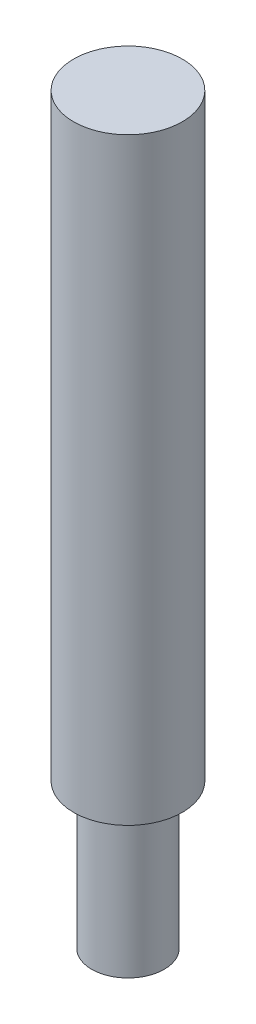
ISO-10303-21;
HEADER;
FILE_DESCRIPTION(('STEP AP214'),'2;1');
FILE_NAME('part.step','',(''),(''),'','','');
FILE_SCHEMA(('AUTOMOTIVE_DESIGN { 1 0 10303 214 1 1 1 1 }'));
ENDSEC;
DATA;
#1=APPLICATION_CONTEXT('core data for automotive mechanical design processes');
#2=APPLICATION_PROTOCOL_DEFINITION('international standard','automotive_design',2000,#1);
#3=PRODUCT_CONTEXT('',#1,'mechanical');
#4=PRODUCT('Part','Part','',(#3));
#5=PRODUCT_RELATED_PRODUCT_CATEGORY('part','',(#4));
#6=PRODUCT_DEFINITION_FORMATION('','',#4);
#7=PRODUCT_DEFINITION_CONTEXT('part definition',#1,'design');
#8=PRODUCT_DEFINITION('design','',#6,#7);
#9=PRODUCT_DEFINITION_SHAPE('','',#8);
#10=(LENGTH_UNIT() NAMED_UNIT(*) SI_UNIT(.MILLI.,.METRE.));
#11=(NAMED_UNIT(*) PLANE_ANGLE_UNIT() SI_UNIT($,.RADIAN.));
#12=(NAMED_UNIT(*) SI_UNIT($,.STERADIAN.) SOLID_ANGLE_UNIT());
#13=UNCERTAINTY_MEASURE_WITH_UNIT(LENGTH_MEASURE(1.E-05),#10,'distance_accuracy_value','');
#14=(GEOMETRIC_REPRESENTATION_CONTEXT(3) GLOBAL_UNCERTAINTY_ASSIGNED_CONTEXT((#13)) GLOBAL_UNIT_ASSIGNED_CONTEXT((#10,
#11,#12)) REPRESENTATION_CONTEXT('',''));
#15=CARTESIAN_POINT('',(0.,0.,0.));
#16=DIRECTION('',(0.,0.,1.));
#17=DIRECTION('',(1.,0.,0.));
#18=AXIS2_PLACEMENT_3D('',#15,#16,#17);
#19=CARTESIAN_POINT('',(1.5,0.,0.));
#20=DIRECTION('',(0.,1.,0.));
#21=DIRECTION('',(0.,0.,1.));
#22=AXIS2_PLACEMENT_3D('',#19,#20,#21);
#23=PLANE('',#22);
#24=CARTESIAN_POINT('',(1.5,0.,0.));
#25=DIRECTION('',(0.,1.,0.));
#26=DIRECTION('',(0.,0.,1.));
#27=AXIS2_PLACEMENT_3D('',#24,#25,#26);
#28=CIRCLE('',#27,1.5);
#29=CARTESIAN_POINT('',(1.5,0.,1.5));
#30=VERTEX_POINT('',#29);
#31=EDGE_CURVE('E110',#30,#30,#28,.T.);
#32=ORIENTED_EDGE('',*,*,#31,.F.);
#33=EDGE_LOOP('',(#32));
#34=FACE_BOUND('',#33,.T.);
#35=CARTESIAN_POINT('',(1.5,0.,0.));
#36=DIRECTION('',(0.,1.,0.));
#37=DIRECTION('',(0.,0.,1.));
#38=AXIS2_PLACEMENT_3D('',#35,#36,#37);
#39=CIRCLE('',#38,1.);
#40=CARTESIAN_POINT('',(1.5,0.,1.));
#41=VERTEX_POINT('',#40);
#42=EDGE_CURVE('E11',#41,#41,#39,.F.);
#43=ORIENTED_EDGE('',*,*,#42,.F.);
#44=EDGE_LOOP('',(#43));
#45=FACE_BOUND('',#44,.T.);
#46=ADVANCED_FACE('F39',(#34,#45),#23,.F.);
#47=CARTESIAN_POINT('',(1.5,16.5,0.));
#48=DIRECTION('',(0.,-1.,0.));
#49=DIRECTION('',(0.,0.,-1.));
#50=AXIS2_PLACEMENT_3D('',#47,#48,#49);
#51=CYLINDRICAL_SURFACE('',#50,1.5);
#52=ORIENTED_EDGE('',*,*,#31,.T.);
#53=EDGE_LOOP('',(#52));
#54=FACE_BOUND('',#53,.T.);
#55=CARTESIAN_POINT('',(1.5,16.5,0.));
#56=DIRECTION('',(0.,1.,0.));
#57=DIRECTION('',(0.,0.,1.));
#58=AXIS2_PLACEMENT_3D('',#55,#56,#57);
#59=CIRCLE('',#58,1.5);
#60=CARTESIAN_POINT('',(1.5,16.5,1.5));
#61=VERTEX_POINT('',#60);
#62=EDGE_CURVE('E114',#61,#61,#59,.T.);
#63=ORIENTED_EDGE('',*,*,#62,.F.);
#64=EDGE_LOOP('',(#63));
#65=FACE_BOUND('',#64,.T.);
#66=CARTESIAN_POINT('',(1.5,12.,0.));
#67=DIRECTION('',(0.,-1.,0.));
#68=DIRECTION('',(0.,0.,-1.));
#69=AXIS2_PLACEMENT_3D('',#66,#67,#68);
#70=CIRCLE('',#69,1.5);
#71=CARTESIAN_POINT('',(0.0857864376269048,12.,0.5));
#72=VERTEX_POINT('',#71);
#73=CARTESIAN_POINT('',(0.0857864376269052,12.,-0.5));
#74=VERTEX_POINT('',#73);
#75=EDGE_CURVE('E117',#72,#74,#70,.T.);
#76=ORIENTED_EDGE('',*,*,#75,.F.);
#77=DIRECTION('',(0.,-1.,0.));
#78=VECTOR('',#77,1.);
#79=CARTESIAN_POINT('',(0.0857864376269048,16.5,0.5));
#80=LINE('',#79,#78);
#81=CARTESIAN_POINT('',(0.0857864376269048,10.5,0.5));
#82=VERTEX_POINT('',#81);
#83=EDGE_CURVE('E47',#72,#82,#80,.T.);
#84=ORIENTED_EDGE('',*,*,#83,.T.);
#85=CARTESIAN_POINT('',(1.5,10.5,0.));
#86=DIRECTION('',(0.,-1.,0.));
#87=DIRECTION('',(0.,0.,-1.));
#88=AXIS2_PLACEMENT_3D('',#85,#86,#87);
#89=CIRCLE('',#88,1.5);
#90=CARTESIAN_POINT('',(0.0857864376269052,10.5,-0.5));
#91=VERTEX_POINT('',#90);
#92=EDGE_CURVE('E54',#82,#91,#89,.T.);
#93=ORIENTED_EDGE('',*,*,#92,.T.);
#94=DIRECTION('',(0.,-1.,0.));
#95=VECTOR('',#94,1.);
#96=CARTESIAN_POINT('',(0.0857864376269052,16.5,-0.5));
#97=LINE('',#96,#95);
#98=EDGE_CURVE('E62',#74,#91,#97,.T.);
#99=ORIENTED_EDGE('',*,*,#98,.F.);
#100=EDGE_LOOP('',(#76,#84,#93,#99));
#101=FACE_BOUND('',#100,.T.);
#102=ADVANCED_FACE('F41',(#54,#65,#101),#51,.T.);
#103=CARTESIAN_POINT('',(1.5,16.5,0.));
#104=DIRECTION('',(0.,1.,0.));
#105=DIRECTION('',(0.,0.,1.));
#106=AXIS2_PLACEMENT_3D('',#103,#104,#105);
#107=PLANE('',#106);
#108=ORIENTED_EDGE('',*,*,#62,.T.);
#109=EDGE_LOOP('',(#108));
#110=FACE_BOUND('',#109,.T.);
#111=ADVANCED_FACE('F134',(#110),#107,.T.);
#112=CARTESIAN_POINT('',(1.,10.5,-0.5));
#113=DIRECTION('',(0.,-1.,0.));
#114=DIRECTION('',(0.,0.,-1.));
#115=AXIS2_PLACEMENT_3D('',#112,#113,#114);
#116=PLANE('',#115);
#117=DIRECTION('',(-1.,0.,0.));
#118=VECTOR('',#117,1.);
#119=CARTESIAN_POINT('',(1.,10.5,0.5));
#120=LINE('',#119,#118);
#121=CARTESIAN_POINT('',(1.,10.5,0.5));
#122=VERTEX_POINT('',#121);
#123=EDGE_CURVE('E79',#122,#82,#120,.T.);
#124=ORIENTED_EDGE('',*,*,#123,.F.);
#125=DIRECTION('',(0.,0.,1.));
#126=VECTOR('',#125,1.);
#127=CARTESIAN_POINT('',(1.,10.5,-0.5));
#128=LINE('',#127,#126);
#129=CARTESIAN_POINT('',(1.,10.5,-0.5));
#130=VERTEX_POINT('',#129);
#131=EDGE_CURVE('E83',#130,#122,#128,.T.);
#132=ORIENTED_EDGE('',*,*,#131,.F.);
#133=DIRECTION('',(-1.,0.,0.));
#134=VECTOR('',#133,1.);
#135=CARTESIAN_POINT('',(1.,10.5,-0.5));
#136=LINE('',#135,#134);
#137=EDGE_CURVE('E108',#130,#91,#136,.T.);
#138=ORIENTED_EDGE('',*,*,#137,.T.);
#139=ORIENTED_EDGE('',*,*,#92,.F.);
#140=EDGE_LOOP('',(#124,#132,#138,#139));
#141=FACE_BOUND('',#140,.T.);
#142=ADVANCED_FACE('F81',(#141),#116,.F.);
#143=CARTESIAN_POINT('',(1.,10.5,-0.5));
#144=DIRECTION('',(0.,0.,1.));
#145=DIRECTION('',(1.,0.,0.));
#146=AXIS2_PLACEMENT_3D('',#143,#144,#145);
#147=PLANE('',#146);
#148=ORIENTED_EDGE('',*,*,#98,.T.);
#149=ORIENTED_EDGE('',*,*,#137,.F.);
#150=DIRECTION('',(0.,1.,0.));
#151=VECTOR('',#150,1.);
#152=CARTESIAN_POINT('',(1.,10.5,-0.5));
#153=LINE('',#152,#151);
#154=CARTESIAN_POINT('',(1.,12.,-0.5));
#155=VERTEX_POINT('',#154);
#156=EDGE_CURVE('E88',#130,#155,#153,.T.);
#157=ORIENTED_EDGE('',*,*,#156,.T.);
#158=DIRECTION('',(-1.,0.,0.));
#159=VECTOR('',#158,1.);
#160=CARTESIAN_POINT('',(1.,12.,-0.5));
#161=LINE('',#160,#159);
#162=EDGE_CURVE('E111',#155,#74,#161,.T.);
#163=ORIENTED_EDGE('',*,*,#162,.T.);
#164=EDGE_LOOP('',(#148,#149,#157,#163));
#165=FACE_BOUND('',#164,.T.);
#166=ADVANCED_FACE('F126',(#165),#147,.T.);
#167=CARTESIAN_POINT('',(1.,12.,-0.5));
#168=DIRECTION('',(0.,-1.,0.));
#169=DIRECTION('',(0.,0.,-1.));
#170=AXIS2_PLACEMENT_3D('',#167,#168,#169);
#171=PLANE('',#170);
#172=DIRECTION('',(-1.,0.,0.));
#173=VECTOR('',#172,1.);
#174=CARTESIAN_POINT('',(1.,12.,0.5));
#175=LINE('',#174,#173);
#176=CARTESIAN_POINT('',(1.,12.,0.5));
#177=VERTEX_POINT('',#176);
#178=EDGE_CURVE('E87',#177,#72,#175,.T.);
#179=ORIENTED_EDGE('',*,*,#178,.T.);
#180=ORIENTED_EDGE('',*,*,#75,.T.);
#181=ORIENTED_EDGE('',*,*,#162,.F.);
#182=DIRECTION('',(0.,0.,1.));
#183=VECTOR('',#182,1.);
#184=CARTESIAN_POINT('',(1.,12.,-0.5));
#185=LINE('',#184,#183);
#186=EDGE_CURVE('E97',#155,#177,#185,.T.);
#187=ORIENTED_EDGE('',*,*,#186,.T.);
#188=EDGE_LOOP('',(#179,#180,#181,#187));
#189=FACE_BOUND('',#188,.T.);
#190=ADVANCED_FACE('F124',(#189),#171,.T.);
#191=CARTESIAN_POINT('',(1.,10.5,0.5));
#192=DIRECTION('',(0.,0.,1.));
#193=DIRECTION('',(1.,0.,0.));
#194=AXIS2_PLACEMENT_3D('',#191,#192,#193);
#195=PLANE('',#194);
#196=ORIENTED_EDGE('',*,*,#178,.F.);
#197=DIRECTION('',(0.,1.,0.));
#198=VECTOR('',#197,1.);
#199=CARTESIAN_POINT('',(1.,10.5,0.5));
#200=LINE('',#199,#198);
#201=EDGE_CURVE('E92',#122,#177,#200,.T.);
#202=ORIENTED_EDGE('',*,*,#201,.F.);
#203=ORIENTED_EDGE('',*,*,#123,.T.);
#204=ORIENTED_EDGE('',*,*,#83,.F.);
#205=EDGE_LOOP('',(#196,#202,#203,#204));
#206=FACE_BOUND('',#205,.T.);
#207=ADVANCED_FACE('F93',(#206),#195,.F.);
#208=CARTESIAN_POINT('',(1.,0.,0.));
#209=DIRECTION('',(-1.,0.,0.));
#210=DIRECTION('',(0.,0.,1.));
#211=AXIS2_PLACEMENT_3D('',#208,#209,#210);
#212=PLANE('',#211);
#213=ORIENTED_EDGE('',*,*,#131,.T.);
#214=ORIENTED_EDGE('',*,*,#201,.T.);
#215=ORIENTED_EDGE('',*,*,#186,.F.);
#216=ORIENTED_EDGE('',*,*,#156,.F.);
#217=EDGE_LOOP('',(#213,#214,#215,#216));
#218=FACE_BOUND('',#217,.T.);
#219=ADVANCED_FACE('F100',(#218),#212,.T.);
#220=CARTESIAN_POINT('',(1.5,-4.,0.));
#221=DIRECTION('',(0.,1.,0.));
#222=DIRECTION('',(0.,0.,1.));
#223=AXIS2_PLACEMENT_3D('',#220,#221,#222);
#224=CYLINDRICAL_SURFACE('',#223,1.);
#225=CARTESIAN_POINT('',(1.5,-4.,0.));
#226=DIRECTION('',(0.,-1.,0.));
#227=DIRECTION('',(0.,0.,-1.));
#228=AXIS2_PLACEMENT_3D('',#225,#226,#227);
#229=CIRCLE('',#228,1.);
#230=CARTESIAN_POINT('',(1.5,-4.,-1.));
#231=VERTEX_POINT('',#230);
#232=EDGE_CURVE('E101',#231,#231,#229,.T.);
#233=ORIENTED_EDGE('',*,*,#232,.F.);
#234=EDGE_LOOP('',(#233));
#235=FACE_BOUND('',#234,.T.);
#236=ORIENTED_EDGE('',*,*,#42,.T.);
#237=EDGE_LOOP('',(#236));
#238=FACE_BOUND('',#237,.T.);
#239=ADVANCED_FACE('F153',(#235,#238),#224,.T.);
#240=CARTESIAN_POINT('',(1.5,-4.,0.));
#241=DIRECTION('',(0.,-1.,0.));
#242=DIRECTION('',(0.,0.,-1.));
#243=AXIS2_PLACEMENT_3D('',#240,#241,#242);
#244=PLANE('',#243);
#245=ORIENTED_EDGE('',*,*,#232,.T.);
#246=EDGE_LOOP('',(#245));
#247=FACE_BOUND('',#246,.T.);
#248=ADVANCED_FACE('F157',(#247),#244,.T.);
#249=CLOSED_SHELL('',(#46,#102,#111,#142,#166,#190,#207,#219,#239,#248));
#250=MANIFOLD_SOLID_BREP('B2',#249);
#251=ADVANCED_BREP_SHAPE_REPRESENTATION('',(#18,#250),#14);
#252=SHAPE_DEFINITION_REPRESENTATION(#9,#251);
ENDSEC;
END-ISO-10303-21;
